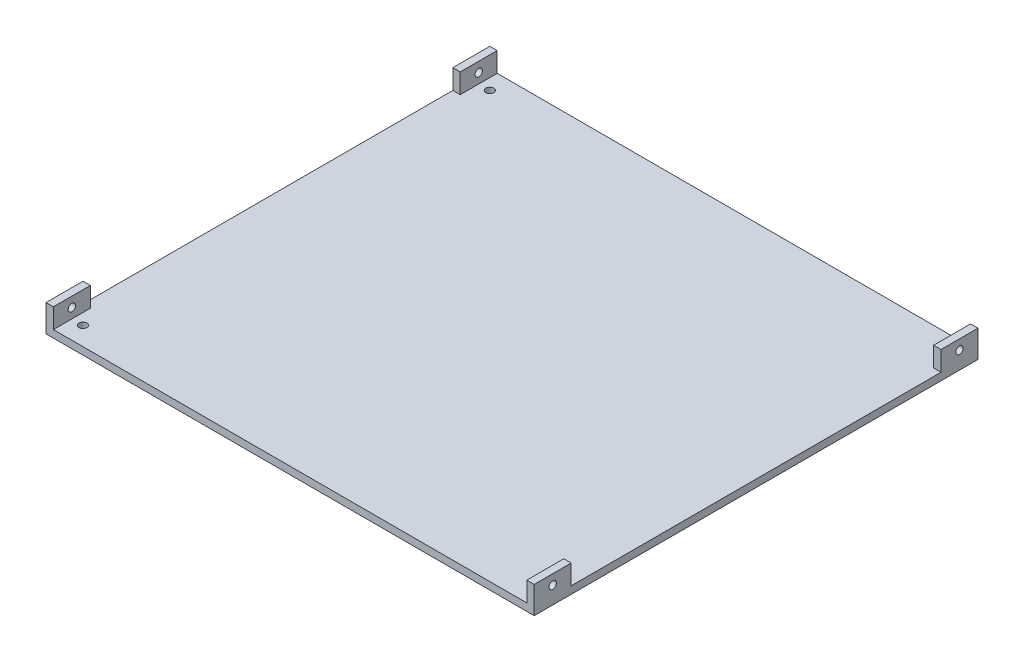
ISO-10303-21;
HEADER;
FILE_DESCRIPTION(('STEP AP214'),'2;1');
FILE_NAME('part.step','',(''),(''),'','','');
FILE_SCHEMA(('AUTOMOTIVE_DESIGN { 1 0 10303 214 1 1 1 1 }'));
ENDSEC;
DATA;
#1=APPLICATION_CONTEXT('core data for automotive mechanical design processes');
#2=APPLICATION_PROTOCOL_DEFINITION('international standard','automotive_design',2000,#1);
#3=PRODUCT_CONTEXT('',#1,'mechanical');
#4=PRODUCT('Part','Part','',(#3));
#5=PRODUCT_RELATED_PRODUCT_CATEGORY('part','',(#4));
#6=PRODUCT_DEFINITION_FORMATION('','',#4);
#7=PRODUCT_DEFINITION_CONTEXT('part definition',#1,'design');
#8=PRODUCT_DEFINITION('design','',#6,#7);
#9=PRODUCT_DEFINITION_SHAPE('','',#8);
#10=(LENGTH_UNIT() NAMED_UNIT(*) SI_UNIT(.MILLI.,.METRE.));
#11=(NAMED_UNIT(*) PLANE_ANGLE_UNIT() SI_UNIT($,.RADIAN.));
#12=(NAMED_UNIT(*) SI_UNIT($,.STERADIAN.) SOLID_ANGLE_UNIT());
#13=UNCERTAINTY_MEASURE_WITH_UNIT(LENGTH_MEASURE(1.E-05),#10,'distance_accuracy_value','');
#14=(GEOMETRIC_REPRESENTATION_CONTEXT(3) GLOBAL_UNCERTAINTY_ASSIGNED_CONTEXT((#13)) GLOBAL_UNIT_ASSIGNED_CONTEXT((#10,
#11,#12)) REPRESENTATION_CONTEXT('',''));
#15=CARTESIAN_POINT('',(0.,0.,0.));
#16=DIRECTION('',(0.,0.,1.));
#17=DIRECTION('',(1.,0.,0.));
#18=AXIS2_PLACEMENT_3D('',#15,#16,#17);
#19=CARTESIAN_POINT('',(0.,0.,0.));
#20=DIRECTION('',(0.,1.,0.));
#21=DIRECTION('',(0.,0.,1.));
#22=AXIS2_PLACEMENT_3D('',#19,#20,#21);
#23=PLANE('',#22);
#24=CARTESIAN_POINT('',(-91.5,0.,82.5));
#25=DIRECTION('',(0.,1.,0.));
#26=DIRECTION('',(0.,0.,-1.));
#27=AXIS2_PLACEMENT_3D('',#24,#25,#26);
#28=CIRCLE('',#27,1.60000000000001);
#29=CARTESIAN_POINT('',(-91.5,0.,80.9));
#30=VERTEX_POINT('',#29);
#31=EDGE_CURVE('E252',#30,#30,#28,.T.);
#32=ORIENTED_EDGE('',*,*,#31,.F.);
#33=EDGE_LOOP('',(#32));
#34=FACE_BOUND('',#33,.T.);
#35=CARTESIAN_POINT('',(91.5,0.,82.5));
#36=DIRECTION('',(0.,1.,0.));
#37=DIRECTION('',(0.,0.,1.));
#38=AXIS2_PLACEMENT_3D('',#35,#36,#37);
#39=CIRCLE('',#38,1.60000000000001);
#40=CARTESIAN_POINT('',(91.5,0.,84.1));
#41=VERTEX_POINT('',#40);
#42=EDGE_CURVE('E256',#41,#41,#39,.T.);
#43=ORIENTED_EDGE('',*,*,#42,.F.);
#44=EDGE_LOOP('',(#43));
#45=FACE_BOUND('',#44,.T.);
#46=CARTESIAN_POINT('',(91.5,0.,-82.5));
#47=DIRECTION('',(0.,1.,0.));
#48=DIRECTION('',(0.,0.,-1.));
#49=AXIS2_PLACEMENT_3D('',#46,#47,#48);
#50=CIRCLE('',#49,1.60000000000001);
#51=CARTESIAN_POINT('',(91.5,0.,-84.1));
#52=VERTEX_POINT('',#51);
#53=EDGE_CURVE('E262',#52,#52,#50,.T.);
#54=ORIENTED_EDGE('',*,*,#53,.F.);
#55=EDGE_LOOP('',(#54));
#56=FACE_BOUND('',#55,.T.);
#57=CARTESIAN_POINT('',(-91.5,0.,-82.5));
#58=DIRECTION('',(0.,1.,0.));
#59=DIRECTION('',(0.,0.,1.));
#60=AXIS2_PLACEMENT_3D('',#57,#58,#59);
#61=CIRCLE('',#60,1.60000000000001);
#62=CARTESIAN_POINT('',(-91.5,0.,-80.9));
#63=VERTEX_POINT('',#62);
#64=EDGE_CURVE('E268',#63,#63,#61,.T.);
#65=ORIENTED_EDGE('',*,*,#64,.F.);
#66=EDGE_LOOP('',(#65));
#67=FACE_BOUND('',#66,.T.);
#68=DIRECTION('',(-1.,0.,0.));
#69=VECTOR('',#68,1.);
#70=CARTESIAN_POINT('',(-99.,0.,74.9999999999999));
#71=LINE('',#70,#69);
#72=CARTESIAN_POINT('',(-96.,0.,74.9999999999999));
#73=VERTEX_POINT('',#72);
#74=CARTESIAN_POINT('',(-99.,0.,74.9999999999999));
#75=VERTEX_POINT('',#74);
#76=EDGE_CURVE('E56',#73,#75,#71,.T.);
#77=ORIENTED_EDGE('',*,*,#76,.F.);
#78=DIRECTION('',(0.,0.,-1.));
#79=VECTOR('',#78,1.);
#80=CARTESIAN_POINT('',(-96.,0.,89.9999999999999));
#81=LINE('',#80,#79);
#82=CARTESIAN_POINT('',(-96.,0.,90.));
#83=VERTEX_POINT('',#82);
#84=EDGE_CURVE('E60',#83,#73,#81,.T.);
#85=ORIENTED_EDGE('',*,*,#84,.F.);
#86=DIRECTION('',(1.,0.,0.));
#87=VECTOR('',#86,1.);
#88=CARTESIAN_POINT('',(-99.,0.,90.));
#89=LINE('',#88,#87);
#90=CARTESIAN_POINT('',(96.,0.,90.));
#91=VERTEX_POINT('',#90);
#92=EDGE_CURVE('E172',#83,#91,#89,.T.);
#93=ORIENTED_EDGE('',*,*,#92,.T.);
#94=DIRECTION('',(0.,0.,1.));
#95=VECTOR('',#94,1.);
#96=CARTESIAN_POINT('',(96.,0.,89.9999999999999));
#97=LINE('',#96,#95);
#98=CARTESIAN_POINT('',(96.,0.,74.9999999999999));
#99=VERTEX_POINT('',#98);
#100=EDGE_CURVE('E176',#99,#91,#97,.T.);
#101=ORIENTED_EDGE('',*,*,#100,.F.);
#102=DIRECTION('',(-1.,0.,0.));
#103=VECTOR('',#102,1.);
#104=CARTESIAN_POINT('',(99.,0.,74.9999999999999));
#105=LINE('',#104,#103);
#106=CARTESIAN_POINT('',(99.,0.,74.9999999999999));
#107=VERTEX_POINT('',#106);
#108=EDGE_CURVE('E173',#107,#99,#105,.T.);
#109=ORIENTED_EDGE('',*,*,#108,.F.);
#110=DIRECTION('',(0.,0.,-1.));
#111=VECTOR('',#110,1.);
#112=CARTESIAN_POINT('',(99.,0.,-90.));
#113=LINE('',#112,#111);
#114=CARTESIAN_POINT('',(99.,0.,-74.9999999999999));
#115=VERTEX_POINT('',#114);
#116=EDGE_CURVE('E274',#107,#115,#113,.T.);
#117=ORIENTED_EDGE('',*,*,#116,.T.);
#118=DIRECTION('',(1.,0.,0.));
#119=VECTOR('',#118,1.);
#120=CARTESIAN_POINT('',(99.,0.,-74.9999999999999));
#121=LINE('',#120,#119);
#122=CARTESIAN_POINT('',(96.,0.,-74.9999999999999));
#123=VERTEX_POINT('',#122);
#124=EDGE_CURVE('E207',#123,#115,#121,.T.);
#125=ORIENTED_EDGE('',*,*,#124,.F.);
#126=DIRECTION('',(0.,0.,1.));
#127=VECTOR('',#126,1.);
#128=CARTESIAN_POINT('',(96.,0.,-89.9999999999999));
#129=LINE('',#128,#127);
#130=CARTESIAN_POINT('',(96.,0.,-90.));
#131=VERTEX_POINT('',#130);
#132=EDGE_CURVE('E202',#131,#123,#129,.T.);
#133=ORIENTED_EDGE('',*,*,#132,.F.);
#134=DIRECTION('',(-1.,0.,0.));
#135=VECTOR('',#134,1.);
#136=CARTESIAN_POINT('',(-99.,0.,-90.));
#137=LINE('',#136,#135);
#138=CARTESIAN_POINT('',(-96.,0.,-90.));
#139=VERTEX_POINT('',#138);
#140=EDGE_CURVE('E291',#131,#139,#137,.T.);
#141=ORIENTED_EDGE('',*,*,#140,.T.);
#142=DIRECTION('',(0.,0.,-1.));
#143=VECTOR('',#142,1.);
#144=CARTESIAN_POINT('',(-96.,0.,-89.9999999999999));
#145=LINE('',#144,#143);
#146=CARTESIAN_POINT('',(-96.,0.,-74.9999999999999));
#147=VERTEX_POINT('',#146);
#148=EDGE_CURVE('E232',#147,#139,#145,.T.);
#149=ORIENTED_EDGE('',*,*,#148,.F.);
#150=DIRECTION('',(1.,0.,0.));
#151=VECTOR('',#150,1.);
#152=CARTESIAN_POINT('',(-99.,0.,-74.9999999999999));
#153=LINE('',#152,#151);
#154=CARTESIAN_POINT('',(-99.,0.,-74.9999999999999));
#155=VERTEX_POINT('',#154);
#156=EDGE_CURVE('E227',#155,#147,#153,.T.);
#157=ORIENTED_EDGE('',*,*,#156,.F.);
#158=DIRECTION('',(0.,0.,1.));
#159=VECTOR('',#158,1.);
#160=CARTESIAN_POINT('',(-99.,0.,-90.));
#161=LINE('',#160,#159);
#162=EDGE_CURVE('E293',#155,#75,#161,.T.);
#163=ORIENTED_EDGE('',*,*,#162,.T.);
#164=EDGE_LOOP('',(#77,#85,#93,#101,#109,#117,#125,#133,#141,#149,#157,#163));
#165=FACE_BOUND('',#164,.T.);
#166=ADVANCED_FACE('F39',(#34,#45,#56,#67,#165),#23,.T.);
#167=CARTESIAN_POINT('',(99.,-3.,-90.));
#168=DIRECTION('',(1.,0.,0.));
#169=DIRECTION('',(0.,0.,-1.));
#170=AXIS2_PLACEMENT_3D('',#167,#168,#169);
#171=PLANE('',#170);
#172=CARTESIAN_POINT('',(99.,4.,82.5));
#173=DIRECTION('',(1.,0.,0.));
#174=DIRECTION('',(0.,0.,-1.));
#175=AXIS2_PLACEMENT_3D('',#172,#173,#174);
#176=CIRCLE('',#175,1.5);
#177=CARTESIAN_POINT('',(99.,4.,81.));
#178=VERTEX_POINT('',#177);
#179=EDGE_CURVE('E308',#178,#178,#176,.T.);
#180=ORIENTED_EDGE('',*,*,#179,.F.);
#181=EDGE_LOOP('',(#180));
#182=FACE_BOUND('',#181,.T.);
#183=CARTESIAN_POINT('',(99.,4.,-82.5));
#184=DIRECTION('',(1.,0.,0.));
#185=DIRECTION('',(0.,0.,1.));
#186=AXIS2_PLACEMENT_3D('',#183,#184,#185);
#187=CIRCLE('',#186,1.5);
#188=CARTESIAN_POINT('',(99.,4.,-81.));
#189=VERTEX_POINT('',#188);
#190=EDGE_CURVE('E316',#189,#189,#187,.T.);
#191=ORIENTED_EDGE('',*,*,#190,.F.);
#192=EDGE_LOOP('',(#191));
#193=FACE_BOUND('',#192,.T.);
#194=ORIENTED_EDGE('',*,*,#116,.F.);
#195=DIRECTION('',(0.,-1.,0.));
#196=VECTOR('',#195,1.);
#197=CARTESIAN_POINT('',(99.,8.,74.9999999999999));
#198=LINE('',#197,#196);
#199=CARTESIAN_POINT('',(99.,8.,74.9999999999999));
#200=VERTEX_POINT('',#199);
#201=EDGE_CURVE('E199',#200,#107,#198,.T.);
#202=ORIENTED_EDGE('',*,*,#201,.F.);
#203=DIRECTION('',(0.,0.,-1.));
#204=VECTOR('',#203,1.);
#205=CARTESIAN_POINT('',(99.,8.,90.));
#206=LINE('',#205,#204);
#207=CARTESIAN_POINT('',(99.,8.,90.));
#208=VERTEX_POINT('',#207);
#209=EDGE_CURVE('E182',#208,#200,#206,.T.);
#210=ORIENTED_EDGE('',*,*,#209,.F.);
#211=DIRECTION('',(0.,1.,0.));
#212=VECTOR('',#211,1.);
#213=CARTESIAN_POINT('',(99.,-3.,90.));
#214=LINE('',#213,#212);
#215=CARTESIAN_POINT('',(99.,-3.,90.));
#216=VERTEX_POINT('',#215);
#217=EDGE_CURVE('E11',#216,#208,#214,.T.);
#218=ORIENTED_EDGE('',*,*,#217,.F.);
#219=DIRECTION('',(0.,0.,-1.));
#220=VECTOR('',#219,1.);
#221=CARTESIAN_POINT('',(99.,-3.,-90.));
#222=LINE('',#221,#220);
#223=CARTESIAN_POINT('',(99.,-3.,-90.));
#224=VERTEX_POINT('',#223);
#225=EDGE_CURVE('E277',#216,#224,#222,.T.);
#226=ORIENTED_EDGE('',*,*,#225,.T.);
#227=DIRECTION('',(0.,1.,0.));
#228=VECTOR('',#227,1.);
#229=CARTESIAN_POINT('',(99.,-3.,-90.));
#230=LINE('',#229,#228);
#231=CARTESIAN_POINT('',(99.,8.,-90.));
#232=VERTEX_POINT('',#231);
#233=EDGE_CURVE('E289',#224,#232,#230,.T.);
#234=ORIENTED_EDGE('',*,*,#233,.T.);
#235=DIRECTION('',(0.,0.,-1.));
#236=VECTOR('',#235,1.);
#237=CARTESIAN_POINT('',(99.,8.,-90.));
#238=LINE('',#237,#236);
#239=CARTESIAN_POINT('',(99.,8.,-74.9999999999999));
#240=VERTEX_POINT('',#239);
#241=EDGE_CURVE('E211',#240,#232,#238,.T.);
#242=ORIENTED_EDGE('',*,*,#241,.F.);
#243=DIRECTION('',(0.,-1.,0.));
#244=VECTOR('',#243,1.);
#245=CARTESIAN_POINT('',(99.,8.,-74.9999999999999));
#246=LINE('',#245,#244);
#247=EDGE_CURVE('E214',#240,#115,#246,.T.);
#248=ORIENTED_EDGE('',*,*,#247,.T.);
#249=EDGE_LOOP('',(#194,#202,#210,#218,#226,#234,#242,#248));
#250=FACE_BOUND('',#249,.T.);
#251=ADVANCED_FACE('F41',(#182,#193,#250),#171,.T.);
#252=CARTESIAN_POINT('',(-99.,-3.,90.));
#253=DIRECTION('',(0.,0.,1.));
#254=DIRECTION('',(1.,0.,0.));
#255=AXIS2_PLACEMENT_3D('',#252,#253,#254);
#256=PLANE('',#255);
#257=ORIENTED_EDGE('',*,*,#92,.F.);
#258=DIRECTION('',(0.,-1.,0.));
#259=VECTOR('',#258,1.);
#260=CARTESIAN_POINT('',(-96.,8.,89.9999999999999));
#261=LINE('',#260,#259);
#262=CARTESIAN_POINT('',(-96.,8.,89.9999999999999));
#263=VERTEX_POINT('',#262);
#264=EDGE_CURVE('E155',#263,#83,#261,.T.);
#265=ORIENTED_EDGE('',*,*,#264,.F.);
#266=DIRECTION('',(1.,0.,0.));
#267=VECTOR('',#266,1.);
#268=CARTESIAN_POINT('',(-99.,8.,90.));
#269=LINE('',#268,#267);
#270=CARTESIAN_POINT('',(-99.,8.,90.));
#271=VERTEX_POINT('',#270);
#272=EDGE_CURVE('E161',#271,#263,#269,.T.);
#273=ORIENTED_EDGE('',*,*,#272,.F.);
#274=DIRECTION('',(0.,1.,0.));
#275=VECTOR('',#274,1.);
#276=CARTESIAN_POINT('',(-99.,-3.,90.));
#277=LINE('',#276,#275);
#278=CARTESIAN_POINT('',(-99.,-3.,90.));
#279=VERTEX_POINT('',#278);
#280=EDGE_CURVE('E48',#279,#271,#277,.T.);
#281=ORIENTED_EDGE('',*,*,#280,.F.);
#282=DIRECTION('',(1.,0.,0.));
#283=VECTOR('',#282,1.);
#284=CARTESIAN_POINT('',(-99.,-3.,90.));
#285=LINE('',#284,#283);
#286=EDGE_CURVE('E286',#279,#216,#285,.T.);
#287=ORIENTED_EDGE('',*,*,#286,.T.);
#288=ORIENTED_EDGE('',*,*,#217,.T.);
#289=DIRECTION('',(1.,0.,0.));
#290=VECTOR('',#289,1.);
#291=CARTESIAN_POINT('',(99.,8.,90.));
#292=LINE('',#291,#290);
#293=CARTESIAN_POINT('',(96.,8.,89.9999999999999));
#294=VERTEX_POINT('',#293);
#295=EDGE_CURVE('E189',#294,#208,#292,.T.);
#296=ORIENTED_EDGE('',*,*,#295,.F.);
#297=DIRECTION('',(0.,-1.,0.));
#298=VECTOR('',#297,1.);
#299=CARTESIAN_POINT('',(96.,8.,89.9999999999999));
#300=LINE('',#299,#298);
#301=EDGE_CURVE('E191',#294,#91,#300,.T.);
#302=ORIENTED_EDGE('',*,*,#301,.T.);
#303=EDGE_LOOP('',(#257,#265,#273,#281,#287,#288,#296,#302));
#304=FACE_BOUND('',#303,.T.);
#305=ADVANCED_FACE('F170',(#304),#256,.T.);
#306=CARTESIAN_POINT('',(-99.,-3.,-90.));
#307=DIRECTION('',(-1.,0.,0.));
#308=DIRECTION('',(0.,0.,1.));
#309=AXIS2_PLACEMENT_3D('',#306,#307,#308);
#310=PLANE('',#309);
#311=CARTESIAN_POINT('',(-99.,4.,82.5));
#312=DIRECTION('',(1.,0.,0.));
#313=DIRECTION('',(0.,0.,-1.));
#314=AXIS2_PLACEMENT_3D('',#311,#312,#313);
#315=CIRCLE('',#314,1.5);
#316=CARTESIAN_POINT('',(-99.,4.,81.));
#317=VERTEX_POINT('',#316);
#318=EDGE_CURVE('E302',#317,#317,#315,.T.);
#319=ORIENTED_EDGE('',*,*,#318,.T.);
#320=EDGE_LOOP('',(#319));
#321=FACE_BOUND('',#320,.T.);
#322=CARTESIAN_POINT('',(-99.,4.,-82.5));
#323=DIRECTION('',(1.,0.,0.));
#324=DIRECTION('',(0.,0.,1.));
#325=AXIS2_PLACEMENT_3D('',#322,#323,#324);
#326=CIRCLE('',#325,1.5);
#327=CARTESIAN_POINT('',(-99.,4.,-81.));
#328=VERTEX_POINT('',#327);
#329=EDGE_CURVE('E313',#328,#328,#326,.T.);
#330=ORIENTED_EDGE('',*,*,#329,.T.);
#331=EDGE_LOOP('',(#330));
#332=FACE_BOUND('',#331,.T.);
#333=ORIENTED_EDGE('',*,*,#162,.F.);
#334=DIRECTION('',(0.,-1.,0.));
#335=VECTOR('',#334,1.);
#336=CARTESIAN_POINT('',(-99.,8.,-74.9999999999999));
#337=LINE('',#336,#335);
#338=CARTESIAN_POINT('',(-99.,8.,-74.9999999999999));
#339=VERTEX_POINT('',#338);
#340=EDGE_CURVE('E249',#339,#155,#337,.T.);
#341=ORIENTED_EDGE('',*,*,#340,.F.);
#342=DIRECTION('',(0.,0.,1.));
#343=VECTOR('',#342,1.);
#344=CARTESIAN_POINT('',(-99.,8.,-90.));
#345=LINE('',#344,#343);
#346=CARTESIAN_POINT('',(-99.,8.,-90.));
#347=VERTEX_POINT('',#346);
#348=EDGE_CURVE('E228',#347,#339,#345,.T.);
#349=ORIENTED_EDGE('',*,*,#348,.F.);
#350=DIRECTION('',(0.,1.,0.));
#351=VECTOR('',#350,1.);
#352=CARTESIAN_POINT('',(-99.,-3.,-90.));
#353=LINE('',#352,#351);
#354=CARTESIAN_POINT('',(-99.,-3.,-90.));
#355=VERTEX_POINT('',#354);
#356=EDGE_CURVE('E297',#355,#347,#353,.T.);
#357=ORIENTED_EDGE('',*,*,#356,.F.);
#358=DIRECTION('',(0.,0.,1.));
#359=VECTOR('',#358,1.);
#360=CARTESIAN_POINT('',(-99.,-3.,-90.));
#361=LINE('',#360,#359);
#362=EDGE_CURVE('E283',#355,#279,#361,.T.);
#363=ORIENTED_EDGE('',*,*,#362,.T.);
#364=ORIENTED_EDGE('',*,*,#280,.T.);
#365=DIRECTION('',(0.,0.,1.));
#366=VECTOR('',#365,1.);
#367=CARTESIAN_POINT('',(-99.,8.,90.));
#368=LINE('',#367,#366);
#369=CARTESIAN_POINT('',(-99.,8.,74.9999999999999));
#370=VERTEX_POINT('',#369);
#371=EDGE_CURVE('E167',#370,#271,#368,.T.);
#372=ORIENTED_EDGE('',*,*,#371,.F.);
#373=DIRECTION('',(0.,-1.,0.));
#374=VECTOR('',#373,1.);
#375=CARTESIAN_POINT('',(-99.,8.,74.9999999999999));
#376=LINE('',#375,#374);
#377=EDGE_CURVE('E178',#370,#75,#376,.T.);
#378=ORIENTED_EDGE('',*,*,#377,.T.);
#379=EDGE_LOOP('',(#333,#341,#349,#357,#363,#364,#372,#378));
#380=FACE_BOUND('',#379,.T.);
#381=ADVANCED_FACE('F331',(#321,#332,#380),#310,.T.);
#382=CARTESIAN_POINT('',(-99.,-3.,-90.));
#383=DIRECTION('',(0.,0.,-1.));
#384=DIRECTION('',(-1.,0.,0.));
#385=AXIS2_PLACEMENT_3D('',#382,#383,#384);
#386=PLANE('',#385);
#387=ORIENTED_EDGE('',*,*,#140,.F.);
#388=DIRECTION('',(0.,-1.,0.));
#389=VECTOR('',#388,1.);
#390=CARTESIAN_POINT('',(96.,8.,-89.9999999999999));
#391=LINE('',#390,#389);
#392=CARTESIAN_POINT('',(96.,8.,-89.9999999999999));
#393=VERTEX_POINT('',#392);
#394=EDGE_CURVE('E224',#393,#131,#391,.T.);
#395=ORIENTED_EDGE('',*,*,#394,.F.);
#396=DIRECTION('',(-1.,0.,0.));
#397=VECTOR('',#396,1.);
#398=CARTESIAN_POINT('',(99.,8.,-90.));
#399=LINE('',#398,#397);
#400=EDGE_CURVE('E203',#232,#393,#399,.T.);
#401=ORIENTED_EDGE('',*,*,#400,.F.);
#402=ORIENTED_EDGE('',*,*,#233,.F.);
#403=DIRECTION('',(-1.,0.,0.));
#404=VECTOR('',#403,1.);
#405=CARTESIAN_POINT('',(-99.,-3.,-90.));
#406=LINE('',#405,#404);
#407=EDGE_CURVE('E280',#224,#355,#406,.T.);
#408=ORIENTED_EDGE('',*,*,#407,.T.);
#409=ORIENTED_EDGE('',*,*,#356,.T.);
#410=DIRECTION('',(-1.,0.,0.));
#411=VECTOR('',#410,1.);
#412=CARTESIAN_POINT('',(-99.,8.,-90.));
#413=LINE('',#412,#411);
#414=CARTESIAN_POINT('',(-96.,8.,-89.9999999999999));
#415=VERTEX_POINT('',#414);
#416=EDGE_CURVE('E236',#415,#347,#413,.T.);
#417=ORIENTED_EDGE('',*,*,#416,.F.);
#418=DIRECTION('',(0.,-1.,0.));
#419=VECTOR('',#418,1.);
#420=CARTESIAN_POINT('',(-96.,8.,-89.9999999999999));
#421=LINE('',#420,#419);
#422=EDGE_CURVE('E239',#415,#139,#421,.T.);
#423=ORIENTED_EDGE('',*,*,#422,.T.);
#424=EDGE_LOOP('',(#387,#395,#401,#402,#408,#409,#417,#423));
#425=FACE_BOUND('',#424,.T.);
#426=ADVANCED_FACE('F361',(#425),#386,.T.);
#427=CARTESIAN_POINT('',(0.,-3.,0.));
#428=DIRECTION('',(0.,1.,0.));
#429=DIRECTION('',(0.,0.,1.));
#430=AXIS2_PLACEMENT_3D('',#427,#428,#429);
#431=PLANE('',#430);
#432=CARTESIAN_POINT('',(-91.5,-3.,82.5));
#433=DIRECTION('',(0.,1.,0.));
#434=DIRECTION('',(0.,0.,-1.));
#435=AXIS2_PLACEMENT_3D('',#432,#433,#434);
#436=CIRCLE('',#435,1.60000000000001);
#437=CARTESIAN_POINT('',(-91.5,-3.,80.9));
#438=VERTEX_POINT('',#437);
#439=EDGE_CURVE('E253',#438,#438,#436,.T.);
#440=ORIENTED_EDGE('',*,*,#439,.T.);
#441=EDGE_LOOP('',(#440));
#442=FACE_BOUND('',#441,.T.);
#443=CARTESIAN_POINT('',(91.5,-3.,82.5));
#444=DIRECTION('',(0.,1.,0.));
#445=DIRECTION('',(0.,0.,1.));
#446=AXIS2_PLACEMENT_3D('',#443,#444,#445);
#447=CIRCLE('',#446,1.60000000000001);
#448=CARTESIAN_POINT('',(91.5,-3.,84.1));
#449=VERTEX_POINT('',#448);
#450=EDGE_CURVE('E259',#449,#449,#447,.T.);
#451=ORIENTED_EDGE('',*,*,#450,.T.);
#452=EDGE_LOOP('',(#451));
#453=FACE_BOUND('',#452,.T.);
#454=CARTESIAN_POINT('',(91.5,-3.,-82.5));
#455=DIRECTION('',(0.,1.,0.));
#456=DIRECTION('',(0.,0.,-1.));
#457=AXIS2_PLACEMENT_3D('',#454,#455,#456);
#458=CIRCLE('',#457,1.60000000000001);
#459=CARTESIAN_POINT('',(91.5,-3.,-84.1));
#460=VERTEX_POINT('',#459);
#461=EDGE_CURVE('E265',#460,#460,#458,.T.);
#462=ORIENTED_EDGE('',*,*,#461,.T.);
#463=EDGE_LOOP('',(#462));
#464=FACE_BOUND('',#463,.T.);
#465=CARTESIAN_POINT('',(-91.5,-3.,-82.5));
#466=DIRECTION('',(0.,1.,0.));
#467=DIRECTION('',(0.,0.,1.));
#468=AXIS2_PLACEMENT_3D('',#465,#466,#467);
#469=CIRCLE('',#468,1.60000000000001);
#470=CARTESIAN_POINT('',(-91.5,-3.,-80.9));
#471=VERTEX_POINT('',#470);
#472=EDGE_CURVE('E271',#471,#471,#469,.T.);
#473=ORIENTED_EDGE('',*,*,#472,.T.);
#474=EDGE_LOOP('',(#473));
#475=FACE_BOUND('',#474,.T.);
#476=ORIENTED_EDGE('',*,*,#225,.F.);
#477=ORIENTED_EDGE('',*,*,#286,.F.);
#478=ORIENTED_EDGE('',*,*,#362,.F.);
#479=ORIENTED_EDGE('',*,*,#407,.F.);
#480=EDGE_LOOP('',(#476,#477,#478,#479));
#481=FACE_BOUND('',#480,.T.);
#482=ADVANCED_FACE('F356',(#442,#453,#464,#475,#481),#431,.F.);
#483=CARTESIAN_POINT('',(-91.5,-3.,-82.5));
#484=DIRECTION('',(0.,1.,0.));
#485=DIRECTION('',(0.,0.,1.));
#486=AXIS2_PLACEMENT_3D('',#483,#484,#485);
#487=CYLINDRICAL_SURFACE('',#486,1.60000000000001);
#488=ORIENTED_EDGE('',*,*,#472,.F.);
#489=EDGE_LOOP('',(#488));
#490=FACE_BOUND('',#489,.T.);
#491=ORIENTED_EDGE('',*,*,#64,.T.);
#492=EDGE_LOOP('',(#491));
#493=FACE_BOUND('',#492,.T.);
#494=ADVANCED_FACE('F367',(#490,#493),#487,.F.);
#495=CARTESIAN_POINT('',(91.5,-3.,-82.5));
#496=DIRECTION('',(0.,1.,0.));
#497=DIRECTION('',(0.,0.,1.));
#498=AXIS2_PLACEMENT_3D('',#495,#496,#497);
#499=CYLINDRICAL_SURFACE('',#498,1.60000000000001);
#500=ORIENTED_EDGE('',*,*,#461,.F.);
#501=EDGE_LOOP('',(#500));
#502=FACE_BOUND('',#501,.T.);
#503=ORIENTED_EDGE('',*,*,#53,.T.);
#504=EDGE_LOOP('',(#503));
#505=FACE_BOUND('',#504,.T.);
#506=ADVANCED_FACE('F432',(#502,#505),#499,.F.);
#507=CARTESIAN_POINT('',(91.5,-3.,82.5));
#508=DIRECTION('',(0.,1.,0.));
#509=DIRECTION('',(0.,0.,1.));
#510=AXIS2_PLACEMENT_3D('',#507,#508,#509);
#511=CYLINDRICAL_SURFACE('',#510,1.60000000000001);
#512=ORIENTED_EDGE('',*,*,#450,.F.);
#513=EDGE_LOOP('',(#512));
#514=FACE_BOUND('',#513,.T.);
#515=ORIENTED_EDGE('',*,*,#42,.T.);
#516=EDGE_LOOP('',(#515));
#517=FACE_BOUND('',#516,.T.);
#518=ADVANCED_FACE('F428',(#514,#517),#511,.F.);
#519=CARTESIAN_POINT('',(-91.5,-3.,82.5));
#520=DIRECTION('',(0.,1.,0.));
#521=DIRECTION('',(0.,0.,1.));
#522=AXIS2_PLACEMENT_3D('',#519,#520,#521);
#523=CYLINDRICAL_SURFACE('',#522,1.60000000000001);
#524=ORIENTED_EDGE('',*,*,#439,.F.);
#525=EDGE_LOOP('',(#524));
#526=FACE_BOUND('',#525,.T.);
#527=ORIENTED_EDGE('',*,*,#31,.T.);
#528=EDGE_LOOP('',(#527));
#529=FACE_BOUND('',#528,.T.);
#530=ADVANCED_FACE('F424',(#526,#529),#523,.F.);
#531=CARTESIAN_POINT('',(-99.,8.,-74.9999999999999));
#532=DIRECTION('',(0.,0.,-1.));
#533=DIRECTION('',(-1.,0.,0.));
#534=AXIS2_PLACEMENT_3D('',#531,#532,#533);
#535=PLANE('',#534);
#536=ORIENTED_EDGE('',*,*,#156,.T.);
#537=DIRECTION('',(0.,-1.,0.));
#538=VECTOR('',#537,1.);
#539=CARTESIAN_POINT('',(-96.,8.,-74.9999999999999));
#540=LINE('',#539,#538);
#541=CARTESIAN_POINT('',(-96.,8.,-74.9999999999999));
#542=VERTEX_POINT('',#541);
#543=EDGE_CURVE('E246',#542,#147,#540,.T.);
#544=ORIENTED_EDGE('',*,*,#543,.F.);
#545=DIRECTION('',(1.,0.,0.));
#546=VECTOR('',#545,1.);
#547=CARTESIAN_POINT('',(-99.,8.,-74.9999999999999));
#548=LINE('',#547,#546);
#549=EDGE_CURVE('E231',#339,#542,#548,.T.);
#550=ORIENTED_EDGE('',*,*,#549,.F.);
#551=ORIENTED_EDGE('',*,*,#340,.T.);
#552=EDGE_LOOP('',(#536,#544,#550,#551));
#553=FACE_BOUND('',#552,.T.);
#554=ADVANCED_FACE('F420',(#553),#535,.F.);
#555=CARTESIAN_POINT('',(-96.,8.,-89.9999999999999));
#556=DIRECTION('',(-1.,0.,0.));
#557=DIRECTION('',(0.,0.,1.));
#558=AXIS2_PLACEMENT_3D('',#555,#556,#557);
#559=PLANE('',#558);
#560=CARTESIAN_POINT('',(-96.,4.,-82.5));
#561=DIRECTION('',(-1.,0.,0.));
#562=DIRECTION('',(0.,0.,1.));
#563=AXIS2_PLACEMENT_3D('',#560,#561,#562);
#564=CIRCLE('',#563,1.5);
#565=CARTESIAN_POINT('',(-96.,4.,-81.));
#566=VERTEX_POINT('',#565);
#567=EDGE_CURVE('E321',#566,#566,#564,.T.);
#568=ORIENTED_EDGE('',*,*,#567,.T.);
#569=EDGE_LOOP('',(#568));
#570=FACE_BOUND('',#569,.T.);
#571=ORIENTED_EDGE('',*,*,#148,.T.);
#572=ORIENTED_EDGE('',*,*,#422,.F.);
#573=DIRECTION('',(0.,0.,-1.));
#574=VECTOR('',#573,1.);
#575=CARTESIAN_POINT('',(-96.,8.,-89.9999999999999));
#576=LINE('',#575,#574);
#577=EDGE_CURVE('E234',#542,#415,#576,.T.);
#578=ORIENTED_EDGE('',*,*,#577,.F.);
#579=ORIENTED_EDGE('',*,*,#543,.T.);
#580=EDGE_LOOP('',(#571,#572,#578,#579));
#581=FACE_BOUND('',#580,.T.);
#582=ADVANCED_FACE('F416',(#570,#581),#559,.F.);
#583=CARTESIAN_POINT('',(0.,8.,0.));
#584=DIRECTION('',(0.,1.,0.));
#585=DIRECTION('',(0.,0.,1.));
#586=AXIS2_PLACEMENT_3D('',#583,#584,#585);
#587=PLANE('',#586);
#588=ORIENTED_EDGE('',*,*,#348,.T.);
#589=ORIENTED_EDGE('',*,*,#549,.T.);
#590=ORIENTED_EDGE('',*,*,#577,.T.);
#591=ORIENTED_EDGE('',*,*,#416,.T.);
#592=EDGE_LOOP('',(#588,#589,#590,#591));
#593=FACE_BOUND('',#592,.T.);
#594=ADVANCED_FACE('F409',(#593),#587,.T.);
#595=CARTESIAN_POINT('',(96.,8.,-89.9999999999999));
#596=DIRECTION('',(1.,0.,0.));
#597=DIRECTION('',(0.,0.,-1.));
#598=AXIS2_PLACEMENT_3D('',#595,#596,#597);
#599=PLANE('',#598);
#600=CARTESIAN_POINT('',(96.,4.,-82.5));
#601=DIRECTION('',(1.,0.,0.));
#602=DIRECTION('',(0.,0.,-1.));
#603=AXIS2_PLACEMENT_3D('',#600,#601,#602);
#604=CIRCLE('',#603,1.5);
#605=CARTESIAN_POINT('',(96.,4.,-84.));
#606=VERTEX_POINT('',#605);
#607=EDGE_CURVE('E43',#606,#606,#604,.T.);
#608=ORIENTED_EDGE('',*,*,#607,.T.);
#609=EDGE_LOOP('',(#608));
#610=FACE_BOUND('',#609,.T.);
#611=ORIENTED_EDGE('',*,*,#132,.T.);
#612=DIRECTION('',(0.,-1.,0.));
#613=VECTOR('',#612,1.);
#614=CARTESIAN_POINT('',(96.,8.,-74.9999999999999));
#615=LINE('',#614,#613);
#616=CARTESIAN_POINT('',(96.,8.,-74.9999999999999));
#617=VERTEX_POINT('',#616);
#618=EDGE_CURVE('E221',#617,#123,#615,.T.);
#619=ORIENTED_EDGE('',*,*,#618,.F.);
#620=DIRECTION('',(0.,0.,1.));
#621=VECTOR('',#620,1.);
#622=CARTESIAN_POINT('',(96.,8.,-89.9999999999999));
#623=LINE('',#622,#621);
#624=EDGE_CURVE('E206',#393,#617,#623,.T.);
#625=ORIENTED_EDGE('',*,*,#624,.F.);
#626=ORIENTED_EDGE('',*,*,#394,.T.);
#627=EDGE_LOOP('',(#611,#619,#625,#626));
#628=FACE_BOUND('',#627,.T.);
#629=ADVANCED_FACE('F375',(#610,#628),#599,.F.);
#630=CARTESIAN_POINT('',(99.,8.,-74.9999999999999));
#631=DIRECTION('',(0.,0.,-1.));
#632=DIRECTION('',(-1.,0.,0.));
#633=AXIS2_PLACEMENT_3D('',#630,#631,#632);
#634=PLANE('',#633);
#635=ORIENTED_EDGE('',*,*,#124,.T.);
#636=ORIENTED_EDGE('',*,*,#247,.F.);
#637=DIRECTION('',(1.,0.,0.));
#638=VECTOR('',#637,1.);
#639=CARTESIAN_POINT('',(99.,8.,-74.9999999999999));
#640=LINE('',#639,#638);
#641=EDGE_CURVE('E209',#617,#240,#640,.T.);
#642=ORIENTED_EDGE('',*,*,#641,.F.);
#643=ORIENTED_EDGE('',*,*,#618,.T.);
#644=EDGE_LOOP('',(#635,#636,#642,#643));
#645=FACE_BOUND('',#644,.T.);
#646=ADVANCED_FACE('F401',(#645),#634,.F.);
#647=CARTESIAN_POINT('',(0.,8.,0.));
#648=DIRECTION('',(0.,1.,0.));
#649=DIRECTION('',(0.,0.,1.));
#650=AXIS2_PLACEMENT_3D('',#647,#648,#649);
#651=PLANE('',#650);
#652=ORIENTED_EDGE('',*,*,#400,.T.);
#653=ORIENTED_EDGE('',*,*,#624,.T.);
#654=ORIENTED_EDGE('',*,*,#641,.T.);
#655=ORIENTED_EDGE('',*,*,#241,.T.);
#656=EDGE_LOOP('',(#652,#653,#654,#655));
#657=FACE_BOUND('',#656,.T.);
#658=ADVANCED_FACE('F379',(#657),#651,.T.);
#659=CARTESIAN_POINT('',(99.,8.,74.9999999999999));
#660=DIRECTION('',(0.,0.,1.));
#661=DIRECTION('',(1.,0.,0.));
#662=AXIS2_PLACEMENT_3D('',#659,#660,#661);
#663=PLANE('',#662);
#664=ORIENTED_EDGE('',*,*,#108,.T.);
#665=DIRECTION('',(0.,-1.,0.));
#666=VECTOR('',#665,1.);
#667=CARTESIAN_POINT('',(96.,8.,74.9999999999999));
#668=LINE('',#667,#666);
#669=CARTESIAN_POINT('',(96.,8.,74.9999999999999));
#670=VERTEX_POINT('',#669);
#671=EDGE_CURVE('E196',#670,#99,#668,.T.);
#672=ORIENTED_EDGE('',*,*,#671,.F.);
#673=DIRECTION('',(-1.,0.,0.));
#674=VECTOR('',#673,1.);
#675=CARTESIAN_POINT('',(99.,8.,74.9999999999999));
#676=LINE('',#675,#674);
#677=EDGE_CURVE('E185',#200,#670,#676,.T.);
#678=ORIENTED_EDGE('',*,*,#677,.F.);
#679=ORIENTED_EDGE('',*,*,#201,.T.);
#680=EDGE_LOOP('',(#664,#672,#678,#679));
#681=FACE_BOUND('',#680,.T.);
#682=ADVANCED_FACE('F398',(#681),#663,.F.);
#683=CARTESIAN_POINT('',(96.,8.,89.9999999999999));
#684=DIRECTION('',(1.,0.,0.));
#685=DIRECTION('',(0.,0.,-1.));
#686=AXIS2_PLACEMENT_3D('',#683,#684,#685);
#687=PLANE('',#686);
#688=CARTESIAN_POINT('',(96.,4.,82.5));
#689=DIRECTION('',(1.,0.,0.));
#690=DIRECTION('',(0.,0.,-1.));
#691=AXIS2_PLACEMENT_3D('',#688,#689,#690);
#692=CIRCLE('',#691,1.5);
#693=CARTESIAN_POINT('',(96.,4.,81.));
#694=VERTEX_POINT('',#693);
#695=EDGE_CURVE('E301',#694,#694,#692,.T.);
#696=ORIENTED_EDGE('',*,*,#695,.T.);
#697=EDGE_LOOP('',(#696));
#698=FACE_BOUND('',#697,.T.);
#699=ORIENTED_EDGE('',*,*,#100,.T.);
#700=ORIENTED_EDGE('',*,*,#301,.F.);
#701=DIRECTION('',(0.,0.,1.));
#702=VECTOR('',#701,1.);
#703=CARTESIAN_POINT('',(96.,8.,89.9999999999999));
#704=LINE('',#703,#702);
#705=EDGE_CURVE('E187',#670,#294,#704,.T.);
#706=ORIENTED_EDGE('',*,*,#705,.F.);
#707=ORIENTED_EDGE('',*,*,#671,.T.);
#708=EDGE_LOOP('',(#699,#700,#706,#707));
#709=FACE_BOUND('',#708,.T.);
#710=ADVANCED_FACE('F396',(#698,#709),#687,.F.);
#711=CARTESIAN_POINT('',(0.,8.,0.));
#712=DIRECTION('',(0.,1.,0.));
#713=DIRECTION('',(0.,0.,1.));
#714=AXIS2_PLACEMENT_3D('',#711,#712,#713);
#715=PLANE('',#714);
#716=ORIENTED_EDGE('',*,*,#209,.T.);
#717=ORIENTED_EDGE('',*,*,#677,.T.);
#718=ORIENTED_EDGE('',*,*,#705,.T.);
#719=ORIENTED_EDGE('',*,*,#295,.T.);
#720=EDGE_LOOP('',(#716,#717,#718,#719));
#721=FACE_BOUND('',#720,.T.);
#722=ADVANCED_FACE('F343',(#721),#715,.T.);
#723=CARTESIAN_POINT('',(-96.,8.,89.9999999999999));
#724=DIRECTION('',(-1.,0.,0.));
#725=DIRECTION('',(0.,0.,1.));
#726=AXIS2_PLACEMENT_3D('',#723,#724,#725);
#727=PLANE('',#726);
#728=CARTESIAN_POINT('',(-96.,4.,82.5));
#729=DIRECTION('',(-1.,0.,0.));
#730=DIRECTION('',(0.,0.,1.));
#731=AXIS2_PLACEMENT_3D('',#728,#729,#730);
#732=CIRCLE('',#731,1.5);
#733=CARTESIAN_POINT('',(-96.,4.,84.));
#734=VERTEX_POINT('',#733);
#735=EDGE_CURVE('E299',#734,#734,#732,.T.);
#736=ORIENTED_EDGE('',*,*,#735,.T.);
#737=EDGE_LOOP('',(#736));
#738=FACE_BOUND('',#737,.T.);
#739=ORIENTED_EDGE('',*,*,#84,.T.);
#740=DIRECTION('',(0.,-1.,0.));
#741=VECTOR('',#740,1.);
#742=CARTESIAN_POINT('',(-96.,8.,74.9999999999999));
#743=LINE('',#742,#741);
#744=CARTESIAN_POINT('',(-96.,8.,74.9999999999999));
#745=VERTEX_POINT('',#744);
#746=EDGE_CURVE('E157',#745,#73,#743,.T.);
#747=ORIENTED_EDGE('',*,*,#746,.F.);
#748=DIRECTION('',(0.,0.,-1.));
#749=VECTOR('',#748,1.);
#750=CARTESIAN_POINT('',(-96.,8.,89.9999999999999));
#751=LINE('',#750,#749);
#752=EDGE_CURVE('E151',#263,#745,#751,.T.);
#753=ORIENTED_EDGE('',*,*,#752,.F.);
#754=ORIENTED_EDGE('',*,*,#264,.T.);
#755=EDGE_LOOP('',(#739,#747,#753,#754));
#756=FACE_BOUND('',#755,.T.);
#757=ADVANCED_FACE('F153',(#738,#756),#727,.F.);
#758=CARTESIAN_POINT('',(-99.,8.,74.9999999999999));
#759=DIRECTION('',(0.,0.,1.));
#760=DIRECTION('',(1.,0.,0.));
#761=AXIS2_PLACEMENT_3D('',#758,#759,#760);
#762=PLANE('',#761);
#763=ORIENTED_EDGE('',*,*,#76,.T.);
#764=ORIENTED_EDGE('',*,*,#377,.F.);
#765=DIRECTION('',(-1.,0.,0.));
#766=VECTOR('',#765,1.);
#767=CARTESIAN_POINT('',(-99.,8.,74.9999999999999));
#768=LINE('',#767,#766);
#769=EDGE_CURVE('E160',#745,#370,#768,.T.);
#770=ORIENTED_EDGE('',*,*,#769,.F.);
#771=ORIENTED_EDGE('',*,*,#746,.T.);
#772=EDGE_LOOP('',(#763,#764,#770,#771));
#773=FACE_BOUND('',#772,.T.);
#774=ADVANCED_FACE('F334',(#773),#762,.F.);
#775=CARTESIAN_POINT('',(0.,8.,0.));
#776=DIRECTION('',(0.,1.,0.));
#777=DIRECTION('',(0.,0.,1.));
#778=AXIS2_PLACEMENT_3D('',#775,#776,#777);
#779=PLANE('',#778);
#780=ORIENTED_EDGE('',*,*,#272,.T.);
#781=ORIENTED_EDGE('',*,*,#752,.T.);
#782=ORIENTED_EDGE('',*,*,#769,.T.);
#783=ORIENTED_EDGE('',*,*,#371,.T.);
#784=EDGE_LOOP('',(#780,#781,#782,#783));
#785=FACE_BOUND('',#784,.T.);
#786=ADVANCED_FACE('F165',(#785),#779,.T.);
#787=CARTESIAN_POINT('',(-99.,4.,82.5));
#788=DIRECTION('',(1.,0.,0.));
#789=DIRECTION('',(0.,0.,-1.));
#790=AXIS2_PLACEMENT_3D('',#787,#788,#789);
#791=CYLINDRICAL_SURFACE('',#790,1.5);
#792=ORIENTED_EDGE('',*,*,#318,.F.);
#793=EDGE_LOOP('',(#792));
#794=FACE_BOUND('',#793,.T.);
#795=ORIENTED_EDGE('',*,*,#735,.F.);
#796=EDGE_LOOP('',(#795));
#797=FACE_BOUND('',#796,.T.);
#798=ADVANCED_FACE('F341',(#794,#797),#791,.F.);
#799=ORIENTED_EDGE('',*,*,#179,.T.);
#800=EDGE_LOOP('',(#799));
#801=FACE_BOUND('',#800,.T.);
#802=ORIENTED_EDGE('',*,*,#695,.F.);
#803=EDGE_LOOP('',(#802));
#804=FACE_BOUND('',#803,.T.);
#805=ADVANCED_FACE('F506',(#801,#804),#791,.F.);
#806=CARTESIAN_POINT('',(-99.,4.,-82.5));
#807=DIRECTION('',(1.,0.,0.));
#808=DIRECTION('',(0.,0.,-1.));
#809=AXIS2_PLACEMENT_3D('',#806,#807,#808);
#810=CYLINDRICAL_SURFACE('',#809,1.5);
#811=ORIENTED_EDGE('',*,*,#190,.T.);
#812=EDGE_LOOP('',(#811));
#813=FACE_BOUND('',#812,.T.);
#814=ORIENTED_EDGE('',*,*,#607,.F.);
#815=EDGE_LOOP('',(#814));
#816=FACE_BOUND('',#815,.T.);
#817=ADVANCED_FACE('F517',(#813,#816),#810,.F.);
#818=ORIENTED_EDGE('',*,*,#329,.F.);
#819=EDGE_LOOP('',(#818));
#820=FACE_BOUND('',#819,.T.);
#821=ORIENTED_EDGE('',*,*,#567,.F.);
#822=EDGE_LOOP('',(#821));
#823=FACE_BOUND('',#822,.T.);
#824=ADVANCED_FACE('F526',(#820,#823),#810,.F.);
#825=CLOSED_SHELL('',(#166,#251,#305,#381,#426,#482,#494,#506,#518,#530,#554,#582,#594,#629,
#646,#658,#682,#710,#722,#757,#774,#786,#798,#805,#817,#824));
#826=MANIFOLD_SOLID_BREP('B2',#825);
#827=ADVANCED_BREP_SHAPE_REPRESENTATION('',(#18,#826),#14);
#828=SHAPE_DEFINITION_REPRESENTATION(#9,#827);
ENDSEC;
END-ISO-10303-21;
